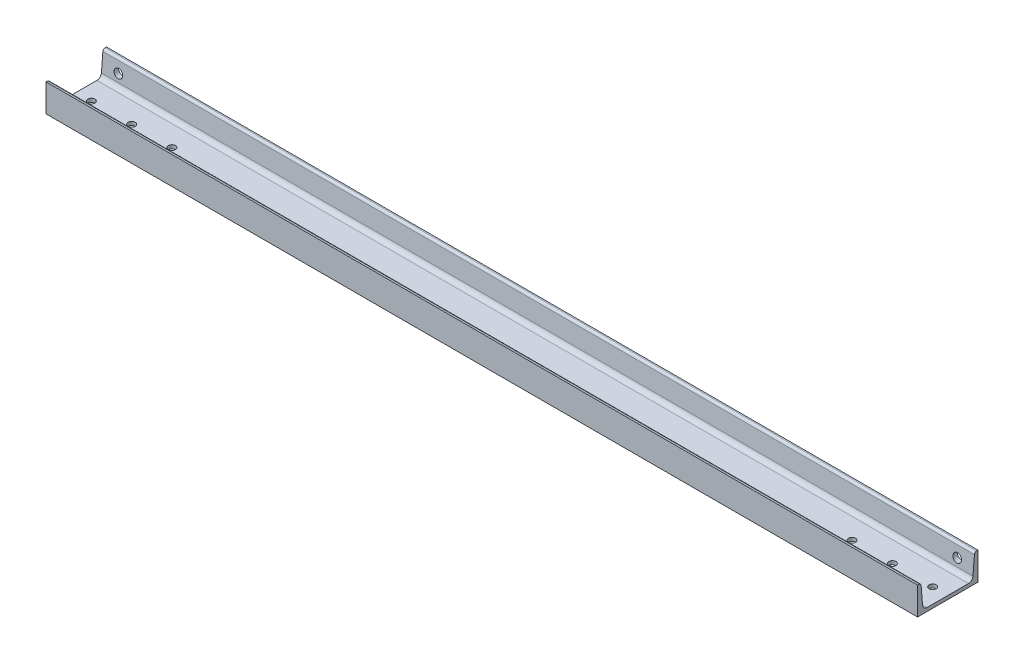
ISO-10303-21;
HEADER;
FILE_DESCRIPTION(('STEP AP214'),'2;1');
FILE_NAME('part.step','',(''),(''),'','','');
FILE_SCHEMA(('AUTOMOTIVE_DESIGN { 1 0 10303 214 1 1 1 1 }'));
ENDSEC;
DATA;
#1=APPLICATION_CONTEXT('core data for automotive mechanical design processes');
#2=APPLICATION_PROTOCOL_DEFINITION('international standard','automotive_design',2000,#1);
#3=PRODUCT_CONTEXT('',#1,'mechanical');
#4=PRODUCT('Part','Part','',(#3));
#5=PRODUCT_RELATED_PRODUCT_CATEGORY('part','',(#4));
#6=PRODUCT_DEFINITION_FORMATION('','',#4);
#7=PRODUCT_DEFINITION_CONTEXT('part definition',#1,'design');
#8=PRODUCT_DEFINITION('design','',#6,#7);
#9=PRODUCT_DEFINITION_SHAPE('','',#8);
#10=(LENGTH_UNIT() NAMED_UNIT(*) SI_UNIT(.MILLI.,.METRE.));
#11=(NAMED_UNIT(*) PLANE_ANGLE_UNIT() SI_UNIT($,.RADIAN.));
#12=(NAMED_UNIT(*) SI_UNIT($,.STERADIAN.) SOLID_ANGLE_UNIT());
#13=UNCERTAINTY_MEASURE_WITH_UNIT(LENGTH_MEASURE(1.E-05),#10,'distance_accuracy_value','');
#14=(GEOMETRIC_REPRESENTATION_CONTEXT(3) GLOBAL_UNCERTAINTY_ASSIGNED_CONTEXT((#13)) GLOBAL_UNIT_ASSIGNED_CONTEXT((#10,
#11,#12)) REPRESENTATION_CONTEXT('',''));
#15=CARTESIAN_POINT('',(0.,0.,0.));
#16=DIRECTION('',(0.,0.,1.));
#17=DIRECTION('',(1.,0.,0.));
#18=AXIS2_PLACEMENT_3D('',#15,#16,#17);
#19=CARTESIAN_POINT('',(865.,6.99999999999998,-41.052087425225));
#20=DIRECTION('',(0.,-1.,0.));
#21=DIRECTION('',(0.,0.,-1.));
#22=AXIS2_PLACEMENT_3D('',#19,#20,#21);
#23=PLANE('',#22);
#24=CARTESIAN_POINT('',(-755.,7.00000000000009,-4.16333634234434E-13));
#25=DIRECTION('',(0.,-1.,0.));
#26=DIRECTION('',(0.,0.,-1.));
#27=AXIS2_PLACEMENT_3D('',#24,#25,#26);
#28=CIRCLE('',#27,6.99999999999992);
#29=CARTESIAN_POINT('',(-755.,7.00000000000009,-7.00000000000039));
#30=VERTEX_POINT('',#29);
#31=EDGE_CURVE('E236',#30,#30,#28,.F.);
#32=ORIENTED_EDGE('',*,*,#31,.F.);
#33=EDGE_LOOP('',(#32));
#34=FACE_BOUND('',#33,.T.);
#35=DIRECTION('',(0.,0.,1.));
#36=VECTOR('',#35,1.);
#37=CARTESIAN_POINT('',(-865.,7.00000000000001,-41.0520874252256));
#38=LINE('',#37,#36);
#39=CARTESIAN_POINT('',(-865.,7.00000000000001,-41.0520874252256));
#40=VERTEX_POINT('',#39);
#41=CARTESIAN_POINT('',(-865.,7.00000000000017,41.0520874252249));
#42=VERTEX_POINT('',#41);
#43=EDGE_CURVE('E151',#40,#42,#38,.T.);
#44=ORIENTED_EDGE('',*,*,#43,.T.);
#45=DIRECTION('',(-1.,0.,0.));
#46=VECTOR('',#45,1.);
#47=CARTESIAN_POINT('',(865.,7.00000000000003,41.0520874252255));
#48=LINE('',#47,#46);
#49=CARTESIAN_POINT('',(865.,7.00000000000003,41.0520874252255));
#50=VERTEX_POINT('',#49);
#51=EDGE_CURVE('E202',#50,#42,#48,.T.);
#52=ORIENTED_EDGE('',*,*,#51,.F.);
#53=DIRECTION('',(0.,0.,1.));
#54=VECTOR('',#53,1.);
#55=CARTESIAN_POINT('',(865.,6.99999999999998,-41.052087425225));
#56=LINE('',#55,#54);
#57=CARTESIAN_POINT('',(865.,6.99999999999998,-41.052087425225));
#58=VERTEX_POINT('',#57);
#59=EDGE_CURVE('E174',#58,#50,#56,.T.);
#60=ORIENTED_EDGE('',*,*,#59,.F.);
#61=DIRECTION('',(-1.,0.,0.));
#62=VECTOR('',#61,1.);
#63=CARTESIAN_POINT('',(865.,6.99999999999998,-41.052087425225));
#64=LINE('',#63,#62);
#65=EDGE_CURVE('E205',#58,#40,#64,.T.);
#66=ORIENTED_EDGE('',*,*,#65,.T.);
#67=EDGE_LOOP('',(#44,#52,#60,#66));
#68=FACE_BOUND('',#67,.T.);
#69=CARTESIAN_POINT('',(834.999999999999,6.9999999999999,2.22044604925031E-13));
#70=DIRECTION('',(0.,-1.,0.));
#71=DIRECTION('',(0.,0.,-1.));
#72=AXIS2_PLACEMENT_3D('',#69,#70,#71);
#73=CIRCLE('',#72,6.99999999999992);
#74=CARTESIAN_POINT('',(834.999999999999,6.9999999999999,-6.99999999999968));
#75=VERTEX_POINT('',#74);
#76=EDGE_CURVE('E139',#75,#75,#73,.T.);
#77=ORIENTED_EDGE('',*,*,#76,.T.);
#78=EDGE_LOOP('',(#77));
#79=FACE_BOUND('',#78,.T.);
#80=CARTESIAN_POINT('',(754.999999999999,7.00000000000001,2.22044604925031E-13));
#81=DIRECTION('',(0.,-1.,0.));
#82=DIRECTION('',(0.,0.,-1.));
#83=AXIS2_PLACEMENT_3D('',#80,#81,#82);
#84=CIRCLE('',#83,6.99999999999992);
#85=CARTESIAN_POINT('',(755.,7.00000000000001,-6.99999999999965));
#86=VERTEX_POINT('',#85);
#87=EDGE_CURVE('E254',#86,#86,#84,.T.);
#88=ORIENTED_EDGE('',*,*,#87,.T.);
#89=EDGE_LOOP('',(#88));
#90=FACE_BOUND('',#89,.T.);
#91=CARTESIAN_POINT('',(674.999999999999,6.9999999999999,2.4980018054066E-13));
#92=DIRECTION('',(0.,-1.,0.));
#93=DIRECTION('',(0.,0.,-1.));
#94=AXIS2_PLACEMENT_3D('',#91,#92,#93);
#95=CIRCLE('',#94,6.99999999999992);
#96=CARTESIAN_POINT('',(675.,6.9999999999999,-6.99999999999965));
#97=VERTEX_POINT('',#96);
#98=EDGE_CURVE('E248',#97,#97,#95,.T.);
#99=ORIENTED_EDGE('',*,*,#98,.T.);
#100=EDGE_LOOP('',(#99));
#101=FACE_BOUND('',#100,.T.);
#102=CARTESIAN_POINT('',(-835.,7.00000000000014,-3.7470027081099E-13));
#103=DIRECTION('',(0.,-1.,0.));
#104=DIRECTION('',(0.,0.,-1.));
#105=AXIS2_PLACEMENT_3D('',#102,#103,#104);
#106=CIRCLE('',#105,6.99999999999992);
#107=CARTESIAN_POINT('',(-835.,7.00000000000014,-7.00000000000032));
#108=VERTEX_POINT('',#107);
#109=EDGE_CURVE('E242',#108,#108,#106,.F.);
#110=ORIENTED_EDGE('',*,*,#109,.F.);
#111=EDGE_LOOP('',(#110));
#112=FACE_BOUND('',#111,.T.);
#113=CARTESIAN_POINT('',(-675.,7.00000000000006,-3.33066907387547E-13));
#114=DIRECTION('',(0.,-1.,0.));
#115=DIRECTION('',(0.,0.,-1.));
#116=AXIS2_PLACEMENT_3D('',#113,#114,#115);
#117=CIRCLE('',#116,6.99999999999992);
#118=CARTESIAN_POINT('',(-675.,7.00000000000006,-7.00000000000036));
#119=VERTEX_POINT('',#118);
#120=EDGE_CURVE('E221',#119,#119,#117,.F.);
#121=ORIENTED_EDGE('',*,*,#120,.F.);
#122=EDGE_LOOP('',(#121));
#123=FACE_BOUND('',#122,.T.);
#124=ADVANCED_FACE('F30',(#34,#68,#79,#90,#101,#112,#123),#23,.F.);
#125=CARTESIAN_POINT('',(865.,0.,60.0000000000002));
#126=DIRECTION('',(0.,1.,0.));
#127=DIRECTION('',(0.,0.,1.));
#128=AXIS2_PLACEMENT_3D('',#125,#126,#127);
#129=PLANE('',#128);
#130=CARTESIAN_POINT('',(-755.,0.,-4.16333634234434E-13));
#131=DIRECTION('',(0.,1.,0.));
#132=DIRECTION('',(0.,0.,-1.));
#133=AXIS2_PLACEMENT_3D('',#130,#131,#132);
#134=CIRCLE('',#133,6.99999999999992);
#135=CARTESIAN_POINT('',(-755.,0.,-7.00000000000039));
#136=VERTEX_POINT('',#135);
#137=EDGE_CURVE('E233',#136,#136,#134,.T.);
#138=ORIENTED_EDGE('',*,*,#137,.T.);
#139=EDGE_LOOP('',(#138));
#140=FACE_BOUND('',#139,.T.);
#141=DIRECTION('',(0.,0.,-1.));
#142=VECTOR('',#141,1.);
#143=CARTESIAN_POINT('',(-865.,1.11022302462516E-13,59.9999999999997));
#144=LINE('',#143,#142);
#145=CARTESIAN_POINT('',(-865.,1.11022302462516E-13,59.9999999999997));
#146=VERTEX_POINT('',#145);
#147=CARTESIAN_POINT('',(-865.,1.66533453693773E-13,-60.0000000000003));
#148=VERTEX_POINT('',#147);
#149=EDGE_CURVE('E163',#146,#148,#144,.T.);
#150=ORIENTED_EDGE('',*,*,#149,.T.);
#151=DIRECTION('',(-1.,0.,0.));
#152=VECTOR('',#151,1.);
#153=CARTESIAN_POINT('',(865.,0.,-59.9999999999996));
#154=LINE('',#153,#152);
#155=CARTESIAN_POINT('',(865.,0.,-59.9999999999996));
#156=VERTEX_POINT('',#155);
#157=EDGE_CURVE('E138',#156,#148,#154,.T.);
#158=ORIENTED_EDGE('',*,*,#157,.F.);
#159=DIRECTION('',(0.,0.,-1.));
#160=VECTOR('',#159,1.);
#161=CARTESIAN_POINT('',(865.,0.,60.0000000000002));
#162=LINE('',#161,#160);
#163=CARTESIAN_POINT('',(865.,0.,60.0000000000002));
#164=VERTEX_POINT('',#163);
#165=EDGE_CURVE('E47',#164,#156,#162,.T.);
#166=ORIENTED_EDGE('',*,*,#165,.F.);
#167=DIRECTION('',(-1.,0.,0.));
#168=VECTOR('',#167,1.);
#169=CARTESIAN_POINT('',(865.,0.,60.0000000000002));
#170=LINE('',#169,#168);
#171=EDGE_CURVE('E187',#164,#146,#170,.T.);
#172=ORIENTED_EDGE('',*,*,#171,.T.);
#173=EDGE_LOOP('',(#150,#158,#166,#172));
#174=FACE_BOUND('',#173,.T.);
#175=CARTESIAN_POINT('',(834.999999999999,-1.94289029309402E-13,1.11022302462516E-13));
#176=DIRECTION('',(0.,-1.,0.));
#177=DIRECTION('',(0.,0.,-1.));
#178=AXIS2_PLACEMENT_3D('',#175,#176,#177);
#179=CIRCLE('',#178,6.99999999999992);
#180=CARTESIAN_POINT('',(834.999999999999,-1.94289029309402E-13,-6.99999999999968));
#181=VERTEX_POINT('',#180);
#182=EDGE_CURVE('E142',#181,#181,#179,.T.);
#183=ORIENTED_EDGE('',*,*,#182,.F.);
#184=EDGE_LOOP('',(#183));
#185=FACE_BOUND('',#184,.T.);
#186=CARTESIAN_POINT('',(755.,0.,2.77555756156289E-13));
#187=DIRECTION('',(0.,-1.,0.));
#188=DIRECTION('',(0.,0.,-1.));
#189=AXIS2_PLACEMENT_3D('',#186,#187,#188);
#190=CIRCLE('',#189,6.99999999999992);
#191=CARTESIAN_POINT('',(755.,0.,-6.99999999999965));
#192=VERTEX_POINT('',#191);
#193=EDGE_CURVE('E251',#192,#192,#190,.T.);
#194=ORIENTED_EDGE('',*,*,#193,.F.);
#195=EDGE_LOOP('',(#194));
#196=FACE_BOUND('',#195,.T.);
#197=CARTESIAN_POINT('',(674.999999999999,0.,1.94289029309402E-13));
#198=DIRECTION('',(0.,-1.,0.));
#199=DIRECTION('',(0.,0.,-1.));
#200=AXIS2_PLACEMENT_3D('',#197,#198,#199);
#201=CIRCLE('',#200,6.99999999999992);
#202=CARTESIAN_POINT('',(675.,0.,-6.99999999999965));
#203=VERTEX_POINT('',#202);
#204=EDGE_CURVE('E245',#203,#203,#201,.T.);
#205=ORIENTED_EDGE('',*,*,#204,.F.);
#206=EDGE_LOOP('',(#205));
#207=FACE_BOUND('',#206,.T.);
#208=CARTESIAN_POINT('',(-835.,1.11022302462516E-13,-3.05311331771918E-13));
#209=DIRECTION('',(0.,1.,0.));
#210=DIRECTION('',(0.,0.,-1.));
#211=AXIS2_PLACEMENT_3D('',#208,#209,#210);
#212=CIRCLE('',#211,6.99999999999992);
#213=CARTESIAN_POINT('',(-835.,1.11022302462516E-13,-7.00000000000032));
#214=VERTEX_POINT('',#213);
#215=EDGE_CURVE('E239',#214,#214,#212,.T.);
#216=ORIENTED_EDGE('',*,*,#215,.T.);
#217=EDGE_LOOP('',(#216));
#218=FACE_BOUND('',#217,.T.);
#219=CARTESIAN_POINT('',(-675.,0.,-3.05311331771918E-13));
#220=DIRECTION('',(0.,1.,0.));
#221=DIRECTION('',(0.,0.,-1.));
#222=AXIS2_PLACEMENT_3D('',#219,#220,#221);
#223=CIRCLE('',#222,6.99999999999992);
#224=CARTESIAN_POINT('',(-675.,0.,-7.00000000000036));
#225=VERTEX_POINT('',#224);
#226=EDGE_CURVE('E216',#225,#225,#223,.T.);
#227=ORIENTED_EDGE('',*,*,#226,.T.);
#228=EDGE_LOOP('',(#227));
#229=FACE_BOUND('',#228,.T.);
#230=ADVANCED_FACE('F262',(#140,#174,#185,#196,#207,#218,#229),#129,.F.);
#231=CARTESIAN_POINT('',(865.,0.,-59.9999999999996));
#232=DIRECTION('',(0.,0.,1.));
#233=DIRECTION('',(0.,-1.,0.));
#234=AXIS2_PLACEMENT_3D('',#231,#232,#233);
#235=PLANE('',#234);
#236=CARTESIAN_POINT('',(832.499999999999,29.9999999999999,-59.9999999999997));
#237=DIRECTION('',(0.,0.,-1.));
#238=DIRECTION('',(0.,1.,0.));
#239=AXIS2_PLACEMENT_3D('',#236,#237,#238);
#240=CIRCLE('',#239,8.4999999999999);
#241=CARTESIAN_POINT('',(832.499999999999,38.4999999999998,-59.9999999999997));
#242=VERTEX_POINT('',#241);
#243=EDGE_CURVE('E228',#242,#242,#240,.T.);
#244=ORIENTED_EDGE('',*,*,#243,.F.);
#245=EDGE_LOOP('',(#244));
#246=FACE_BOUND('',#245,.T.);
#247=CARTESIAN_POINT('',(-832.5,30.,-60.0000000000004));
#248=DIRECTION('',(0.,0.,-1.));
#249=DIRECTION('',(0.,1.,0.));
#250=AXIS2_PLACEMENT_3D('',#247,#248,#249);
#251=CIRCLE('',#250,8.4999999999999);
#252=CARTESIAN_POINT('',(-832.5,38.4999999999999,-60.0000000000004));
#253=VERTEX_POINT('',#252);
#254=EDGE_CURVE('E217',#253,#253,#251,.T.);
#255=ORIENTED_EDGE('',*,*,#254,.F.);
#256=EDGE_LOOP('',(#255));
#257=FACE_BOUND('',#256,.T.);
#258=DIRECTION('',(0.,1.,0.));
#259=VECTOR('',#258,1.);
#260=CARTESIAN_POINT('',(-865.,1.66533453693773E-13,-60.0000000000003));
#261=LINE('',#260,#259);
#262=CARTESIAN_POINT('',(-865.,55.0000000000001,-60.0000000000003));
#263=VERTEX_POINT('',#262);
#264=EDGE_CURVE('E125',#148,#263,#261,.T.);
#265=ORIENTED_EDGE('',*,*,#264,.T.);
#266=DIRECTION('',(-1.,0.,0.));
#267=VECTOR('',#266,1.);
#268=CARTESIAN_POINT('',(864.999999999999,54.9999999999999,-59.9999999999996));
#269=LINE('',#268,#267);
#270=CARTESIAN_POINT('',(864.999999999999,54.9999999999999,-59.9999999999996));
#271=VERTEX_POINT('',#270);
#272=EDGE_CURVE('E11',#271,#263,#269,.T.);
#273=ORIENTED_EDGE('',*,*,#272,.F.);
#274=DIRECTION('',(0.,1.,0.));
#275=VECTOR('',#274,1.);
#276=CARTESIAN_POINT('',(865.,0.,-59.9999999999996));
#277=LINE('',#276,#275);
#278=EDGE_CURVE('E165',#156,#271,#277,.T.);
#279=ORIENTED_EDGE('',*,*,#278,.F.);
#280=ORIENTED_EDGE('',*,*,#157,.T.);
#281=EDGE_LOOP('',(#265,#273,#279,#280));
#282=FACE_BOUND('',#281,.T.);
#283=ADVANCED_FACE('F32',(#246,#257,#282),#235,.F.);
#284=CARTESIAN_POINT('',(864.999999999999,54.9999999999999,-59.9999999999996));
#285=DIRECTION('',(0.,-1.,0.));
#286=DIRECTION('',(0.,0.,-1.));
#287=AXIS2_PLACEMENT_3D('',#284,#285,#286);
#288=PLANE('',#287);
#289=DIRECTION('',(0.,0.,1.));
#290=VECTOR('',#289,1.);
#291=CARTESIAN_POINT('',(-865.,55.0000000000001,-60.0000000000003));
#292=LINE('',#291,#290);
#293=CARTESIAN_POINT('',(-865.,55.0000000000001,-57.352768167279));
#294=VERTEX_POINT('',#293);
#295=EDGE_CURVE('E121',#263,#294,#292,.T.);
#296=ORIENTED_EDGE('',*,*,#295,.T.);
#297=DIRECTION('',(-1.,0.,0.));
#298=VECTOR('',#297,1.);
#299=CARTESIAN_POINT('',(865.,54.9999999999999,-57.3527681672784));
#300=LINE('',#299,#298);
#301=CARTESIAN_POINT('',(865.,54.9999999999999,-57.3527681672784));
#302=VERTEX_POINT('',#301);
#303=EDGE_CURVE('E39',#302,#294,#300,.T.);
#304=ORIENTED_EDGE('',*,*,#303,.F.);
#305=DIRECTION('',(0.,0.,1.));
#306=VECTOR('',#305,1.);
#307=CARTESIAN_POINT('',(864.999999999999,54.9999999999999,-59.9999999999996));
#308=LINE('',#307,#306);
#309=EDGE_CURVE('E134',#271,#302,#308,.T.);
#310=ORIENTED_EDGE('',*,*,#309,.F.);
#311=ORIENTED_EDGE('',*,*,#272,.T.);
#312=EDGE_LOOP('',(#296,#304,#310,#311));
#313=FACE_BOUND('',#312,.T.);
#314=ADVANCED_FACE('F133',(#313),#288,.F.);
#315=CARTESIAN_POINT('',(864.999999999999,50.4999999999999,-57.3527681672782));
#316=DIRECTION('',(-1.,0.,0.));
#317=DIRECTION('',(0.,0.,1.));
#318=AXIS2_PLACEMENT_3D('',#315,#316,#317);
#319=CYLINDRICAL_SURFACE('',#318,4.5);
#320=CARTESIAN_POINT('',(-865.,50.5000000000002,-57.3527681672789));
#321=DIRECTION('',(1.,0.,0.));
#322=DIRECTION('',(0.,0.,-1.));
#323=AXIS2_PLACEMENT_3D('',#320,#321,#322);
#324=CIRCLE('',#323,4.5);
#325=CARTESIAN_POINT('',(-865.,50.8585465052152,-52.8670748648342));
#326=VERTEX_POINT('',#325);
#327=EDGE_CURVE('E127',#294,#326,#324,.T.);
#328=ORIENTED_EDGE('',*,*,#327,.T.);
#329=DIRECTION('',(-1.,0.,0.));
#330=VECTOR('',#329,1.);
#331=CARTESIAN_POINT('',(865.,50.858546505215,-52.8670748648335));
#332=LINE('',#331,#330);
#333=CARTESIAN_POINT('',(865.,50.858546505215,-52.8670748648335));
#334=VERTEX_POINT('',#333);
#335=EDGE_CURVE('E211',#334,#326,#332,.T.);
#336=ORIENTED_EDGE('',*,*,#335,.F.);
#337=CARTESIAN_POINT('',(864.999999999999,50.4999999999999,-57.3527681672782));
#338=DIRECTION('',(1.,0.,0.));
#339=DIRECTION('',(0.,0.,-1.));
#340=AXIS2_PLACEMENT_3D('',#337,#338,#339);
#341=CIRCLE('',#340,4.5);
#342=EDGE_CURVE('E168',#302,#334,#341,.T.);
#343=ORIENTED_EDGE('',*,*,#342,.F.);
#344=ORIENTED_EDGE('',*,*,#303,.T.);
#345=EDGE_LOOP('',(#328,#336,#343,#344));
#346=FACE_BOUND('',#345,.T.);
#347=ADVANCED_FACE('F301',(#346),#319,.T.);
#348=CARTESIAN_POINT('',(865.,50.858546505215,-52.8670748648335));
#349=DIRECTION('',(0.,-0.0796770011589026,-0.99682073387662));
#350=DIRECTION('',(0.,0.996820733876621,-0.0796770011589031));
#351=AXIS2_PLACEMENT_3D('',#348,#349,#350);
#352=PLANE('',#351);
#353=CARTESIAN_POINT('',(832.499999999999,29.9999999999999,-51.1998278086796));
#354=DIRECTION('',(0.,-0.0796770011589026,-0.99682073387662));
#355=DIRECTION('',(0.,0.996820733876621,-0.0796770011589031));
#356=AXIS2_PLACEMENT_3D('',#353,#354,#355);
#357=ELLIPSE('',#356,8.52710995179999,8.4999999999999);
#358=CARTESIAN_POINT('',(832.499999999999,38.4999999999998,-51.8792423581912));
#359=VERTEX_POINT('',#358);
#360=EDGE_CURVE('E34',#359,#359,#357,.T.);
#361=ORIENTED_EDGE('',*,*,#360,.T.);
#362=EDGE_LOOP('',(#361));
#363=FACE_BOUND('',#362,.T.);
#364=CARTESIAN_POINT('',(-832.5,30.0000000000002,-51.1998278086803));
#365=DIRECTION('',(0.,-0.0796770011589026,-0.99682073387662));
#366=DIRECTION('',(0.,0.996820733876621,-0.0796770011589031));
#367=AXIS2_PLACEMENT_3D('',#364,#365,#366);
#368=ELLIPSE('',#367,8.52710995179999,8.4999999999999);
#369=CARTESIAN_POINT('',(-832.5,38.5000000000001,-51.879242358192));
#370=VERTEX_POINT('',#369);
#371=EDGE_CURVE('E214',#370,#370,#368,.T.);
#372=ORIENTED_EDGE('',*,*,#371,.T.);
#373=EDGE_LOOP('',(#372));
#374=FACE_BOUND('',#373,.T.);
#375=DIRECTION('',(0.,-0.99682073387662,0.0796770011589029));
#376=VECTOR('',#375,1.);
#377=CARTESIAN_POINT('',(-865.,50.8585465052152,-52.8670748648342));
#378=LINE('',#377,#376);
#379=CARTESIAN_POINT('',(-865.,15.28290698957,-50.0234740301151));
#380=VERTEX_POINT('',#379);
#381=EDGE_CURVE('E147',#326,#380,#378,.T.);
#382=ORIENTED_EDGE('',*,*,#381,.T.);
#383=DIRECTION('',(-1.,0.,0.));
#384=VECTOR('',#383,1.);
#385=CARTESIAN_POINT('',(864.999999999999,15.2829069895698,-50.0234740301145));
#386=LINE('',#385,#384);
#387=CARTESIAN_POINT('',(864.999999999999,15.2829069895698,-50.0234740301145));
#388=VERTEX_POINT('',#387);
#389=EDGE_CURVE('E208',#388,#380,#386,.T.);
#390=ORIENTED_EDGE('',*,*,#389,.F.);
#391=DIRECTION('',(0.,-0.99682073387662,0.0796770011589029));
#392=VECTOR('',#391,1.);
#393=CARTESIAN_POINT('',(865.,50.858546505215,-52.8670748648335));
#394=LINE('',#393,#392);
#395=EDGE_CURVE('E170',#334,#388,#394,.T.);
#396=ORIENTED_EDGE('',*,*,#395,.F.);
#397=ORIENTED_EDGE('',*,*,#335,.T.);
#398=EDGE_LOOP('',(#382,#390,#396,#397));
#399=FACE_BOUND('',#398,.T.);
#400=ADVANCED_FACE('F297',(#363,#374,#399),#352,.F.);
#401=CARTESIAN_POINT('',(864.999999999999,15.9999999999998,-41.0520874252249));
#402=DIRECTION('',(-1.,0.,0.));
#403=DIRECTION('',(0.,0.,1.));
#404=AXIS2_PLACEMENT_3D('',#401,#402,#403);
#405=CYLINDRICAL_SURFACE('',#404,9.);
#406=CARTESIAN_POINT('',(-865.,16.,-41.0520874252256));
#407=DIRECTION('',(-1.,0.,0.));
#408=DIRECTION('',(0.,0.,1.));
#409=AXIS2_PLACEMENT_3D('',#406,#407,#408);
#410=CIRCLE('',#409,9.);
#411=EDGE_CURVE('E149',#380,#40,#410,.T.);
#412=ORIENTED_EDGE('',*,*,#411,.T.);
#413=ORIENTED_EDGE('',*,*,#65,.F.);
#414=CARTESIAN_POINT('',(864.999999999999,15.9999999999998,-41.0520874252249));
#415=DIRECTION('',(-1.,0.,0.));
#416=DIRECTION('',(0.,0.,1.));
#417=AXIS2_PLACEMENT_3D('',#414,#415,#416);
#418=CIRCLE('',#417,9.);
#419=EDGE_CURVE('E172',#388,#58,#418,.T.);
#420=ORIENTED_EDGE('',*,*,#419,.F.);
#421=ORIENTED_EDGE('',*,*,#389,.T.);
#422=EDGE_LOOP('',(#412,#413,#420,#421));
#423=FACE_BOUND('',#422,.T.);
#424=ADVANCED_FACE('F294',(#423),#405,.F.);
#425=CARTESIAN_POINT('',(864.999999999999,15.9999999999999,41.0520874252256));
#426=DIRECTION('',(-1.,0.,0.));
#427=DIRECTION('',(0.,0.,1.));
#428=AXIS2_PLACEMENT_3D('',#425,#426,#427);
#429=CYLINDRICAL_SURFACE('',#428,9.);
#430=CARTESIAN_POINT('',(-865.,16.,41.052087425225));
#431=DIRECTION('',(-1.,0.,0.));
#432=DIRECTION('',(0.,0.,-1.));
#433=AXIS2_PLACEMENT_3D('',#430,#431,#432);
#434=CIRCLE('',#433,9.);
#435=CARTESIAN_POINT('',(-865.,15.28290698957,50.0234740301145));
#436=VERTEX_POINT('',#435);
#437=EDGE_CURVE('E153',#42,#436,#434,.T.);
#438=ORIENTED_EDGE('',*,*,#437,.T.);
#439=DIRECTION('',(-1.,0.,0.));
#440=VECTOR('',#439,1.);
#441=CARTESIAN_POINT('',(864.999999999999,15.2829069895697,50.0234740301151));
#442=LINE('',#441,#440);
#443=CARTESIAN_POINT('',(864.999999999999,15.2829069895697,50.0234740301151));
#444=VERTEX_POINT('',#443);
#445=EDGE_CURVE('E199',#444,#436,#442,.T.);
#446=ORIENTED_EDGE('',*,*,#445,.F.);
#447=CARTESIAN_POINT('',(864.999999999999,15.9999999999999,41.0520874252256));
#448=DIRECTION('',(-1.,0.,0.));
#449=DIRECTION('',(0.,0.,-1.));
#450=AXIS2_PLACEMENT_3D('',#447,#448,#449);
#451=CIRCLE('',#450,9.);
#452=EDGE_CURVE('E176',#50,#444,#451,.T.);
#453=ORIENTED_EDGE('',*,*,#452,.F.);
#454=ORIENTED_EDGE('',*,*,#51,.T.);
#455=EDGE_LOOP('',(#438,#446,#453,#454));
#456=FACE_BOUND('',#455,.T.);
#457=ADVANCED_FACE('F292',(#456),#429,.F.);
#458=CARTESIAN_POINT('',(865.,50.8585465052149,52.8670748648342));
#459=DIRECTION('',(0.,-0.079677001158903,0.99682073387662));
#460=DIRECTION('',(0.,-0.996820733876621,-0.0796770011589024));
#461=AXIS2_PLACEMENT_3D('',#458,#459,#460);
#462=PLANE('',#461);
#463=DIRECTION('',(0.,0.99682073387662,0.0796770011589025));
#464=VECTOR('',#463,1.);
#465=CARTESIAN_POINT('',(-865.,50.8585465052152,52.8670748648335));
#466=LINE('',#465,#464);
#467=CARTESIAN_POINT('',(-865.,50.8585465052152,52.8670748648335));
#468=VERTEX_POINT('',#467);
#469=EDGE_CURVE('E155',#436,#468,#466,.T.);
#470=ORIENTED_EDGE('',*,*,#469,.T.);
#471=DIRECTION('',(-1.,0.,0.));
#472=VECTOR('',#471,1.);
#473=CARTESIAN_POINT('',(865.,50.8585465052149,52.8670748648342));
#474=LINE('',#473,#472);
#475=CARTESIAN_POINT('',(865.,50.8585465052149,52.8670748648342));
#476=VERTEX_POINT('',#475);
#477=EDGE_CURVE('E196',#476,#468,#474,.T.);
#478=ORIENTED_EDGE('',*,*,#477,.F.);
#479=DIRECTION('',(0.,0.99682073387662,0.0796770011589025));
#480=VECTOR('',#479,1.);
#481=CARTESIAN_POINT('',(865.,50.8585465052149,52.8670748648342));
#482=LINE('',#481,#480);
#483=EDGE_CURVE('E178',#444,#476,#482,.T.);
#484=ORIENTED_EDGE('',*,*,#483,.F.);
#485=ORIENTED_EDGE('',*,*,#445,.T.);
#486=EDGE_LOOP('',(#470,#478,#484,#485));
#487=FACE_BOUND('',#486,.T.);
#488=ADVANCED_FACE('F344',(#487),#462,.F.);
#489=CARTESIAN_POINT('',(865.,50.5,57.3527681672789));
#490=DIRECTION('',(-1.,0.,0.));
#491=DIRECTION('',(0.,0.,1.));
#492=AXIS2_PLACEMENT_3D('',#489,#490,#491);
#493=CYLINDRICAL_SURFACE('',#492,4.5);
#494=CARTESIAN_POINT('',(-865.,50.5000000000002,57.3527681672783));
#495=DIRECTION('',(1.,0.,0.));
#496=DIRECTION('',(0.,0.,1.));
#497=AXIS2_PLACEMENT_3D('',#494,#495,#496);
#498=CIRCLE('',#497,4.5);
#499=CARTESIAN_POINT('',(-865.,55.,57.3527681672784));
#500=VERTEX_POINT('',#499);
#501=EDGE_CURVE('E157',#468,#500,#498,.T.);
#502=ORIENTED_EDGE('',*,*,#501,.T.);
#503=DIRECTION('',(-1.,0.,0.));
#504=VECTOR('',#503,1.);
#505=CARTESIAN_POINT('',(865.,54.9999999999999,57.352768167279));
#506=LINE('',#505,#504);
#507=CARTESIAN_POINT('',(865.,54.9999999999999,57.352768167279));
#508=VERTEX_POINT('',#507);
#509=EDGE_CURVE('E193',#508,#500,#506,.T.);
#510=ORIENTED_EDGE('',*,*,#509,.F.);
#511=CARTESIAN_POINT('',(865.,50.5,57.3527681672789));
#512=DIRECTION('',(1.,0.,0.));
#513=DIRECTION('',(0.,0.,1.));
#514=AXIS2_PLACEMENT_3D('',#511,#512,#513);
#515=CIRCLE('',#514,4.5);
#516=EDGE_CURVE('E180',#476,#508,#515,.T.);
#517=ORIENTED_EDGE('',*,*,#516,.F.);
#518=ORIENTED_EDGE('',*,*,#477,.T.);
#519=EDGE_LOOP('',(#502,#510,#517,#518));
#520=FACE_BOUND('',#519,.T.);
#521=ADVANCED_FACE('F347',(#520),#493,.T.);
#522=CARTESIAN_POINT('',(864.999999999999,54.9999999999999,60.0000000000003));
#523=DIRECTION('',(0.,-1.,0.));
#524=DIRECTION('',(0.,0.,-1.));
#525=AXIS2_PLACEMENT_3D('',#522,#523,#524);
#526=PLANE('',#525);
#527=DIRECTION('',(0.,0.,1.));
#528=VECTOR('',#527,1.);
#529=CARTESIAN_POINT('',(-865.,55.,59.9999999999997));
#530=LINE('',#529,#528);
#531=CARTESIAN_POINT('',(-865.,55.,59.9999999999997));
#532=VERTEX_POINT('',#531);
#533=EDGE_CURVE('E159',#500,#532,#530,.T.);
#534=ORIENTED_EDGE('',*,*,#533,.T.);
#535=DIRECTION('',(-1.,0.,0.));
#536=VECTOR('',#535,1.);
#537=CARTESIAN_POINT('',(864.999999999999,54.9999999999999,60.0000000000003));
#538=LINE('',#537,#536);
#539=CARTESIAN_POINT('',(864.999999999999,54.9999999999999,60.0000000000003));
#540=VERTEX_POINT('',#539);
#541=EDGE_CURVE('E190',#540,#532,#538,.T.);
#542=ORIENTED_EDGE('',*,*,#541,.F.);
#543=DIRECTION('',(0.,0.,1.));
#544=VECTOR('',#543,1.);
#545=CARTESIAN_POINT('',(864.999999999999,54.9999999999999,60.0000000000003));
#546=LINE('',#545,#544);
#547=EDGE_CURVE('E182',#508,#540,#546,.T.);
#548=ORIENTED_EDGE('',*,*,#547,.F.);
#549=ORIENTED_EDGE('',*,*,#509,.T.);
#550=EDGE_LOOP('',(#534,#542,#548,#549));
#551=FACE_BOUND('',#550,.T.);
#552=ADVANCED_FACE('F352',(#551),#526,.F.);
#553=CARTESIAN_POINT('',(865.,0.,60.0000000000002));
#554=DIRECTION('',(0.,0.,-1.));
#555=DIRECTION('',(0.,1.,0.));
#556=AXIS2_PLACEMENT_3D('',#553,#554,#555);
#557=PLANE('',#556);
#558=DIRECTION('',(0.,-1.,0.));
#559=VECTOR('',#558,1.);
#560=CARTESIAN_POINT('',(-865.,1.11022302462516E-13,59.9999999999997));
#561=LINE('',#560,#559);
#562=EDGE_CURVE('E161',#532,#146,#561,.T.);
#563=ORIENTED_EDGE('',*,*,#562,.T.);
#564=ORIENTED_EDGE('',*,*,#171,.F.);
#565=DIRECTION('',(0.,-1.,0.));
#566=VECTOR('',#565,1.);
#567=CARTESIAN_POINT('',(865.,0.,60.0000000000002));
#568=LINE('',#567,#566);
#569=EDGE_CURVE('E52',#540,#164,#568,.T.);
#570=ORIENTED_EDGE('',*,*,#569,.F.);
#571=ORIENTED_EDGE('',*,*,#541,.T.);
#572=EDGE_LOOP('',(#563,#564,#570,#571));
#573=FACE_BOUND('',#572,.T.);
#574=ADVANCED_FACE('F355',(#573),#557,.F.);
#575=CARTESIAN_POINT('',(864.999999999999,50.4999999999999,-57.3527681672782));
#576=DIRECTION('',(1.,0.,0.));
#577=DIRECTION('',(0.,0.,-1.));
#578=AXIS2_PLACEMENT_3D('',#575,#576,#577);
#579=PLANE('',#578);
#580=ORIENTED_EDGE('',*,*,#278,.T.);
#581=ORIENTED_EDGE('',*,*,#309,.T.);
#582=ORIENTED_EDGE('',*,*,#342,.T.);
#583=ORIENTED_EDGE('',*,*,#395,.T.);
#584=ORIENTED_EDGE('',*,*,#419,.T.);
#585=ORIENTED_EDGE('',*,*,#59,.T.);
#586=ORIENTED_EDGE('',*,*,#452,.T.);
#587=ORIENTED_EDGE('',*,*,#483,.T.);
#588=ORIENTED_EDGE('',*,*,#516,.T.);
#589=ORIENTED_EDGE('',*,*,#547,.T.);
#590=ORIENTED_EDGE('',*,*,#569,.T.);
#591=ORIENTED_EDGE('',*,*,#165,.T.);
#592=EDGE_LOOP('',(#580,#581,#582,#583,#584,#585,#586,#587,#588,#589,#590,#591));
#593=FACE_BOUND('',#592,.T.);
#594=ADVANCED_FACE('F338',(#593),#579,.T.);
#595=CARTESIAN_POINT('',(-865.,50.5000000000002,-57.3527681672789));
#596=DIRECTION('',(1.,0.,0.));
#597=DIRECTION('',(0.,0.,-1.));
#598=AXIS2_PLACEMENT_3D('',#595,#596,#597);
#599=PLANE('',#598);
#600=ORIENTED_EDGE('',*,*,#264,.F.);
#601=ORIENTED_EDGE('',*,*,#149,.F.);
#602=ORIENTED_EDGE('',*,*,#562,.F.);
#603=ORIENTED_EDGE('',*,*,#533,.F.);
#604=ORIENTED_EDGE('',*,*,#501,.F.);
#605=ORIENTED_EDGE('',*,*,#469,.F.);
#606=ORIENTED_EDGE('',*,*,#437,.F.);
#607=ORIENTED_EDGE('',*,*,#43,.F.);
#608=ORIENTED_EDGE('',*,*,#411,.F.);
#609=ORIENTED_EDGE('',*,*,#381,.F.);
#610=ORIENTED_EDGE('',*,*,#327,.F.);
#611=ORIENTED_EDGE('',*,*,#295,.F.);
#612=EDGE_LOOP('',(#600,#601,#602,#603,#604,#605,#606,#607,#608,#609,#610,#611));
#613=FACE_BOUND('',#612,.T.);
#614=ADVANCED_FACE('F122',(#613),#599,.F.);
#615=CARTESIAN_POINT('',(834.999999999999,54.9999999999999,2.4980018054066E-13));
#616=DIRECTION('',(0.,-1.,0.));
#617=DIRECTION('',(0.,0.,-1.));
#618=AXIS2_PLACEMENT_3D('',#615,#616,#617);
#619=CYLINDRICAL_SURFACE('',#618,6.99999999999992);
#620=CARTESIAN_POINT('',(834.999999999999,-1.94289029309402E-13,-6.99999999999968));
#621=CARTESIAN_POINT('',(834.999999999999,0.0729166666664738,-6.99999999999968));
#622=CARTESIAN_POINT('',(834.999999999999,0.145833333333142,-6.99999999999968));
#623=CARTESIAN_POINT('',(834.999999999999,0.291666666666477,-6.99999999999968));
#624=CARTESIAN_POINT('',(834.999999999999,0.364583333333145,-6.99999999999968));
#625=CARTESIAN_POINT('',(834.999999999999,0.510416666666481,-6.99999999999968));
#626=CARTESIAN_POINT('',(834.999999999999,0.583333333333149,-6.99999999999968));
#627=CARTESIAN_POINT('',(834.999999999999,0.729166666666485,-6.99999999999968));
#628=CARTESIAN_POINT('',(834.999999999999,0.802083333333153,-6.99999999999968));
#629=CARTESIAN_POINT('',(834.999999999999,0.947916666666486,-6.99999999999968));
#630=CARTESIAN_POINT('',(834.999999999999,1.02083333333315,-6.99999999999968));
#631=CARTESIAN_POINT('',(834.999999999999,1.16666666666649,-6.99999999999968));
#632=CARTESIAN_POINT('',(834.999999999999,1.23958333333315,-6.99999999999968));
#633=CARTESIAN_POINT('',(834.999999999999,1.38541666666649,-6.99999999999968));
#634=CARTESIAN_POINT('',(834.999999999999,1.45833333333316,-6.99999999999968));
#635=CARTESIAN_POINT('',(834.999999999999,1.60416666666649,-6.99999999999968));
#636=CARTESIAN_POINT('',(834.999999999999,1.67708333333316,-6.99999999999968));
#637=CARTESIAN_POINT('',(834.999999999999,1.8229166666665,-6.99999999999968));
#638=CARTESIAN_POINT('',(834.999999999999,1.89583333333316,-6.99999999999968));
#639=CARTESIAN_POINT('',(834.999999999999,2.0416666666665,-6.99999999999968));
#640=CARTESIAN_POINT('',(834.999999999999,2.11458333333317,-6.99999999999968));
#641=CARTESIAN_POINT('',(834.999999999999,2.2604166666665,-6.99999999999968));
#642=CARTESIAN_POINT('',(834.999999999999,2.33333333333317,-6.99999999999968));
#643=CARTESIAN_POINT('',(834.999999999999,2.4791666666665,-6.99999999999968));
#644=CARTESIAN_POINT('',(834.999999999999,2.55208333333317,-6.99999999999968));
#645=CARTESIAN_POINT('',(834.999999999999,2.6979166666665,-6.99999999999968));
#646=CARTESIAN_POINT('',(834.999999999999,2.77083333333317,-6.99999999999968));
#647=CARTESIAN_POINT('',(834.999999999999,2.91666666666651,-6.99999999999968));
#648=CARTESIAN_POINT('',(834.999999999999,2.98958333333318,-6.99999999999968));
#649=CARTESIAN_POINT('',(834.999999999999,3.13541666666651,-6.99999999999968));
#650=CARTESIAN_POINT('',(834.999999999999,3.20833333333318,-6.99999999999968));
#651=CARTESIAN_POINT('',(834.999999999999,3.35416666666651,-6.99999999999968));
#652=CARTESIAN_POINT('',(834.999999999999,3.42708333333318,-6.99999999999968));
#653=CARTESIAN_POINT('',(834.999999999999,3.57291666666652,-6.99999999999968));
#654=CARTESIAN_POINT('',(834.999999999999,3.64583333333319,-6.99999999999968));
#655=CARTESIAN_POINT('',(834.999999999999,3.79166666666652,-6.99999999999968));
#656=CARTESIAN_POINT('',(834.999999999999,3.86458333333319,-6.99999999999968));
#657=CARTESIAN_POINT('',(834.999999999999,4.01041666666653,-6.99999999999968));
#658=CARTESIAN_POINT('',(834.999999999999,4.08333333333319,-6.99999999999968));
#659=CARTESIAN_POINT('',(834.999999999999,4.22916666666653,-6.99999999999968));
#660=CARTESIAN_POINT('',(834.999999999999,4.3020833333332,-6.99999999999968));
#661=CARTESIAN_POINT('',(834.999999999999,4.44791666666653,-6.99999999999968));
#662=CARTESIAN_POINT('',(834.999999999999,4.5208333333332,-6.99999999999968));
#663=CARTESIAN_POINT('',(834.999999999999,4.66666666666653,-6.99999999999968));
#664=CARTESIAN_POINT('',(834.999999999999,4.7395833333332,-6.99999999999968));
#665=CARTESIAN_POINT('',(834.999999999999,4.88541666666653,-6.99999999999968));
#666=CARTESIAN_POINT('',(834.999999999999,4.9583333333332,-6.99999999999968));
#667=CARTESIAN_POINT('',(834.999999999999,5.10416666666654,-6.99999999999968));
#668=CARTESIAN_POINT('',(834.999999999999,5.1770833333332,-6.99999999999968));
#669=CARTESIAN_POINT('',(834.999999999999,5.32291666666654,-6.99999999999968));
#670=CARTESIAN_POINT('',(834.999999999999,5.39583333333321,-6.99999999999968));
#671=CARTESIAN_POINT('',(834.999999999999,5.54166666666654,-6.99999999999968));
#672=CARTESIAN_POINT('',(834.999999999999,5.61458333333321,-6.99999999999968));
#673=CARTESIAN_POINT('',(834.999999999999,5.76041666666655,-6.99999999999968));
#674=CARTESIAN_POINT('',(834.999999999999,5.83333333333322,-6.99999999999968));
#675=CARTESIAN_POINT('',(834.999999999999,5.97916666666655,-6.99999999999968));
#676=CARTESIAN_POINT('',(834.999999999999,6.05208333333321,-6.99999999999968));
#677=CARTESIAN_POINT('',(834.999999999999,6.19791666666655,-6.99999999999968));
#678=CARTESIAN_POINT('',(834.999999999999,6.27083333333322,-6.99999999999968));
#679=CARTESIAN_POINT('',(834.999999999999,6.41666666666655,-6.99999999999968));
#680=CARTESIAN_POINT('',(834.999999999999,6.48958333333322,-6.99999999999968));
#681=CARTESIAN_POINT('',(834.999999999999,6.63541666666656,-6.99999999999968));
#682=CARTESIAN_POINT('',(834.999999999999,6.70833333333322,-6.99999999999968));
#683=CARTESIAN_POINT('',(834.999999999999,6.85416666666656,-6.99999999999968));
#684=CARTESIAN_POINT('',(834.999999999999,6.92708333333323,-6.99999999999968));
#685=CARTESIAN_POINT('',(834.999999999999,6.9999999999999,-6.99999999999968));
#686=B_SPLINE_CURVE_WITH_KNOTS('',3,(#620,#621,#622,#623,#624,#625,#626,#627,#628,#629,#630,
#631,#632,#633,#634,#635,#636,#637,#638,#639,#640,#641,#642,#643,#644,#645,#646,#647,#648,#649,
#650,#651,#652,#653,#654,#655,#656,#657,#658,#659,#660,#661,#662,#663,#664,#665,#666,#667,#668,
#669,#670,#671,#672,#673,#674,#675,#676,#677,#678,#679,#680,#681,#682,#683,#684,#685),
.UNSPECIFIED.,.F.,.F.,(4,2,2,2,2,2,2,2,2,2,2,2,2,2,2,2,2,2,2,2,2,2,2,2,2,2,2,2,2,2,2,2,4),(0.,
0.218750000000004,0.437500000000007,0.656250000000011,0.875000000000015,1.09375000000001,
1.31250000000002,1.53125000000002,1.75000000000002,1.96875000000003,2.18750000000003,
2.40625000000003,2.62500000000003,2.84375000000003,3.06250000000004,3.28125000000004,
3.50000000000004,3.71875000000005,3.93750000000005,4.15625000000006,4.37500000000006,
4.59375000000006,4.81250000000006,5.03125000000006,5.25000000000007,5.46875000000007,
5.68750000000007,5.90625000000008,6.12500000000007,6.34375000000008,6.56250000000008,
6.78125000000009,7.00000000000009),.UNSPECIFIED.);
#687=EDGE_CURVE('BSEAM259',#181,#75,#686,.T.);
#688=ORIENTED_EDGE('',*,*,#182,.T.);
#689=ORIENTED_EDGE('',*,*,#76,.F.);
#690=ORIENTED_EDGE('',*,*,#687,.T.);
#691=ORIENTED_EDGE('',*,*,#687,.F.);
#692=EDGE_LOOP('',(#688,#690,#689,#691));
#693=FACE_BOUND('',#692,.T.);
#694=ADVANCED_FACE('F259',(#693),#619,.F.);
#695=CARTESIAN_POINT('',(755.,55.,2.77555756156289E-13));
#696=DIRECTION('',(0.,-1.,0.));
#697=DIRECTION('',(0.,0.,-1.));
#698=AXIS2_PLACEMENT_3D('',#695,#696,#697);
#699=CYLINDRICAL_SURFACE('',#698,6.99999999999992);
#700=CARTESIAN_POINT('',(755.,0.,-6.99999999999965));
#701=CARTESIAN_POINT('',(755.,0.0729166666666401,-6.99999999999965));
#702=CARTESIAN_POINT('',(755.,0.145833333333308,-6.99999999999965));
#703=CARTESIAN_POINT('',(755.,0.291666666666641,-6.99999999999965));
#704=CARTESIAN_POINT('',(755.,0.364583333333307,-6.99999999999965));
#705=CARTESIAN_POINT('',(755.,0.510416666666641,-6.99999999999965));
#706=CARTESIAN_POINT('',(755.,0.583333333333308,-6.99999999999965));
#707=CARTESIAN_POINT('',(755.,0.729166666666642,-6.99999999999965));
#708=CARTESIAN_POINT('',(755.,0.802083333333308,-6.99999999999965));
#709=CARTESIAN_POINT('',(755.,0.947916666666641,-6.99999999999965));
#710=CARTESIAN_POINT('',(755.,1.02083333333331,-6.99999999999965));
#711=CARTESIAN_POINT('',(755.,1.16666666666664,-6.99999999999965));
#712=CARTESIAN_POINT('',(755.,1.23958333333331,-6.99999999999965));
#713=CARTESIAN_POINT('',(755.,1.38541666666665,-6.99999999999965));
#714=CARTESIAN_POINT('',(755.,1.45833333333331,-6.99999999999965));
#715=CARTESIAN_POINT('',(755.,1.60416666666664,-6.99999999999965));
#716=CARTESIAN_POINT('',(755.,1.67708333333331,-6.99999999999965));
#717=CARTESIAN_POINT('',(755.,1.82291666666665,-6.99999999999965));
#718=CARTESIAN_POINT('',(755.,1.89583333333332,-6.99999999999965));
#719=CARTESIAN_POINT('',(755.,2.04166666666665,-6.99999999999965));
#720=CARTESIAN_POINT('',(755.,2.11458333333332,-6.99999999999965));
#721=CARTESIAN_POINT('',(755.,2.26041666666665,-6.99999999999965));
#722=CARTESIAN_POINT('',(755.,2.33333333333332,-6.99999999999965));
#723=CARTESIAN_POINT('',(755.,2.47916666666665,-6.99999999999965));
#724=CARTESIAN_POINT('',(755.,2.55208333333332,-6.99999999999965));
#725=CARTESIAN_POINT('',(755.,2.69791666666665,-6.99999999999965));
#726=CARTESIAN_POINT('',(755.,2.77083333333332,-6.99999999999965));
#727=CARTESIAN_POINT('',(755.,2.91666666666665,-6.99999999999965));
#728=CARTESIAN_POINT('',(755.,2.98958333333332,-6.99999999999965));
#729=CARTESIAN_POINT('',(755.,3.13541666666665,-6.99999999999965));
#730=CARTESIAN_POINT('',(755.,3.20833333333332,-6.99999999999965));
#731=CARTESIAN_POINT('',(755.,3.35416666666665,-6.99999999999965));
#732=CARTESIAN_POINT('',(755.,3.42708333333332,-6.99999999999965));
#733=CARTESIAN_POINT('',(755.,3.57291666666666,-6.99999999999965));
#734=CARTESIAN_POINT('',(755.,3.64583333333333,-6.99999999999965));
#735=CARTESIAN_POINT('',(755.,3.79166666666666,-6.99999999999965));
#736=CARTESIAN_POINT('',(755.,3.86458333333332,-6.99999999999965));
#737=CARTESIAN_POINT('',(755.,4.01041666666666,-6.99999999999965));
#738=CARTESIAN_POINT('',(755.,4.08333333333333,-6.99999999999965));
#739=CARTESIAN_POINT('',(755.,4.22916666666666,-6.99999999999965));
#740=CARTESIAN_POINT('',(755.,4.30208333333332,-6.99999999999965));
#741=CARTESIAN_POINT('',(755.,4.44791666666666,-6.99999999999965));
#742=CARTESIAN_POINT('',(755.,4.52083333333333,-6.99999999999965));
#743=CARTESIAN_POINT('',(755.,4.66666666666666,-6.99999999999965));
#744=CARTESIAN_POINT('',(755.,4.73958333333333,-6.99999999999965));
#745=CARTESIAN_POINT('',(755.,4.88541666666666,-6.99999999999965));
#746=CARTESIAN_POINT('',(755.,4.95833333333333,-6.99999999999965));
#747=CARTESIAN_POINT('',(755.,5.10416666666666,-6.99999999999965));
#748=CARTESIAN_POINT('',(755.,5.17708333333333,-6.99999999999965));
#749=CARTESIAN_POINT('',(755.,5.32291666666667,-6.99999999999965));
#750=CARTESIAN_POINT('',(755.,5.39583333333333,-6.99999999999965));
#751=CARTESIAN_POINT('',(755.,5.54166666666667,-6.99999999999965));
#752=CARTESIAN_POINT('',(755.,5.61458333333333,-6.99999999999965));
#753=CARTESIAN_POINT('',(755.,5.76041666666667,-6.99999999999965));
#754=CARTESIAN_POINT('',(755.,5.83333333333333,-6.99999999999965));
#755=CARTESIAN_POINT('',(755.,5.97916666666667,-6.99999999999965));
#756=CARTESIAN_POINT('',(755.,6.05208333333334,-6.99999999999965));
#757=CARTESIAN_POINT('',(755.,6.19791666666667,-6.99999999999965));
#758=CARTESIAN_POINT('',(755.,6.27083333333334,-6.99999999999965));
#759=CARTESIAN_POINT('',(755.,6.41666666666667,-6.99999999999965));
#760=CARTESIAN_POINT('',(755.,6.48958333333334,-6.99999999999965));
#761=CARTESIAN_POINT('',(755.,6.63541666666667,-6.99999999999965));
#762=CARTESIAN_POINT('',(755.,6.70833333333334,-6.99999999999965));
#763=CARTESIAN_POINT('',(755.,6.85416666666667,-6.99999999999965));
#764=CARTESIAN_POINT('',(755.,6.92708333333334,-6.99999999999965));
#765=CARTESIAN_POINT('',(755.,7.00000000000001,-6.99999999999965));
#766=B_SPLINE_CURVE_WITH_KNOTS('',3,(#700,#701,#702,#703,#704,#705,#706,#707,#708,#709,#710,
#711,#712,#713,#714,#715,#716,#717,#718,#719,#720,#721,#722,#723,#724,#725,#726,#727,#728,#729,
#730,#731,#732,#733,#734,#735,#736,#737,#738,#739,#740,#741,#742,#743,#744,#745,#746,#747,#748,
#749,#750,#751,#752,#753,#754,#755,#756,#757,#758,#759,#760,#761,#762,#763,#764,#765),
.UNSPECIFIED.,.F.,.F.,(4,2,2,2,2,2,2,2,2,2,2,2,2,2,2,2,2,2,2,2,2,2,2,2,2,2,2,2,2,2,2,2,4),(0.,
0.218750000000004,0.4375,0.656250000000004,0.875000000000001,1.09375,1.31250000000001,1.53125,
1.75000000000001,1.96875000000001,2.18750000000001,2.40625000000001,2.62500000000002,
2.84375000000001,3.06250000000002,3.28125000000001,3.50000000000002,3.71875000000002,
3.93750000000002,4.15625000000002,4.37500000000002,4.59375000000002,4.81250000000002,
5.03125000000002,5.25000000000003,5.46875000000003,5.68750000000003,5.90625000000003,
6.12500000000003,6.34375000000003,6.56250000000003,6.78125000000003,7.00000000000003),.UNSPECIFIED.);
#767=EDGE_CURVE('BSEAM418',#192,#86,#766,.T.);
#768=ORIENTED_EDGE('',*,*,#193,.T.);
#769=ORIENTED_EDGE('',*,*,#87,.F.);
#770=ORIENTED_EDGE('',*,*,#767,.T.);
#771=ORIENTED_EDGE('',*,*,#767,.F.);
#772=EDGE_LOOP('',(#768,#770,#769,#771));
#773=FACE_BOUND('',#772,.T.);
#774=ADVANCED_FACE('F418',(#773),#699,.F.);
#775=CARTESIAN_POINT('',(675.,54.9999999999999,2.77555756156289E-13));
#776=DIRECTION('',(0.,-1.,0.));
#777=DIRECTION('',(0.,0.,-1.));
#778=AXIS2_PLACEMENT_3D('',#775,#776,#777);
#779=CYLINDRICAL_SURFACE('',#778,6.99999999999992);
#780=CARTESIAN_POINT('',(675.,0.,-6.99999999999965));
#781=CARTESIAN_POINT('',(675.,0.0729166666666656,-6.99999999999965));
#782=CARTESIAN_POINT('',(675.,0.145833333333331,-6.99999999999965));
#783=CARTESIAN_POINT('',(675.,0.291666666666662,-6.99999999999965));
#784=CARTESIAN_POINT('',(675.,0.364583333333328,-6.99999999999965));
#785=CARTESIAN_POINT('',(675.,0.510416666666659,-6.99999999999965));
#786=CARTESIAN_POINT('',(675.,0.583333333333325,-6.99999999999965));
#787=CARTESIAN_POINT('',(675.,0.729166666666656,-6.99999999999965));
#788=CARTESIAN_POINT('',(675.,0.802083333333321,-6.99999999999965));
#789=CARTESIAN_POINT('',(675.,0.947916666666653,-6.99999999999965));
#790=CARTESIAN_POINT('',(675.,1.02083333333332,-6.99999999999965));
#791=CARTESIAN_POINT('',(675.,1.16666666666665,-6.99999999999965));
#792=CARTESIAN_POINT('',(675.,1.23958333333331,-6.99999999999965));
#793=CARTESIAN_POINT('',(675.,1.38541666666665,-6.99999999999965));
#794=CARTESIAN_POINT('',(675.,1.45833333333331,-6.99999999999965));
#795=CARTESIAN_POINT('',(675.,1.60416666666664,-6.99999999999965));
#796=CARTESIAN_POINT('',(675.,1.67708333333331,-6.99999999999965));
#797=CARTESIAN_POINT('',(675.,1.82291666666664,-6.99999999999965));
#798=CARTESIAN_POINT('',(675.,1.89583333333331,-6.99999999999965));
#799=CARTESIAN_POINT('',(675.,2.04166666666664,-6.99999999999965));
#800=CARTESIAN_POINT('',(675.,2.1145833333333,-6.99999999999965));
#801=CARTESIAN_POINT('',(675.,2.26041666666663,-6.99999999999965));
#802=CARTESIAN_POINT('',(675.,2.3333333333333,-6.99999999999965));
#803=CARTESIAN_POINT('',(675.,2.47916666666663,-6.99999999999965));
#804=CARTESIAN_POINT('',(675.,2.5520833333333,-6.99999999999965));
#805=CARTESIAN_POINT('',(675.,2.69791666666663,-6.99999999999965));
#806=CARTESIAN_POINT('',(675.,2.77083333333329,-6.99999999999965));
#807=CARTESIAN_POINT('',(675.,2.91666666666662,-6.99999999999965));
#808=CARTESIAN_POINT('',(675.,2.98958333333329,-6.99999999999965));
#809=CARTESIAN_POINT('',(675.,3.13541666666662,-6.99999999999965));
#810=CARTESIAN_POINT('',(675.,3.20833333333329,-6.99999999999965));
#811=CARTESIAN_POINT('',(675.,3.35416666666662,-6.99999999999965));
#812=CARTESIAN_POINT('',(675.,3.42708333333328,-6.99999999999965));
#813=CARTESIAN_POINT('',(675.,3.57291666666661,-6.99999999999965));
#814=CARTESIAN_POINT('',(675.,3.64583333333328,-6.99999999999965));
#815=CARTESIAN_POINT('',(675.,3.79166666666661,-6.99999999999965));
#816=CARTESIAN_POINT('',(675.,3.86458333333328,-6.99999999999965));
#817=CARTESIAN_POINT('',(675.,4.01041666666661,-6.99999999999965));
#818=CARTESIAN_POINT('',(675.,4.08333333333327,-6.99999999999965));
#819=CARTESIAN_POINT('',(675.,4.2291666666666,-6.99999999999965));
#820=CARTESIAN_POINT('',(675.,4.30208333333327,-6.99999999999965));
#821=CARTESIAN_POINT('',(675.,4.4479166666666,-6.99999999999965));
#822=CARTESIAN_POINT('',(675.,4.52083333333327,-6.99999999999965));
#823=CARTESIAN_POINT('',(675.,4.6666666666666,-6.99999999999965));
#824=CARTESIAN_POINT('',(675.,4.73958333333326,-6.99999999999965));
#825=CARTESIAN_POINT('',(675.,4.88541666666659,-6.99999999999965));
#826=CARTESIAN_POINT('',(675.,4.95833333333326,-6.99999999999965));
#827=CARTESIAN_POINT('',(675.,5.10416666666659,-6.99999999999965));
#828=CARTESIAN_POINT('',(675.,5.17708333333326,-6.99999999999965));
#829=CARTESIAN_POINT('',(675.,5.32291666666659,-6.99999999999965));
#830=CARTESIAN_POINT('',(675.,5.39583333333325,-6.99999999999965));
#831=CARTESIAN_POINT('',(675.,5.54166666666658,-6.99999999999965));
#832=CARTESIAN_POINT('',(675.,5.61458333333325,-6.99999999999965));
#833=CARTESIAN_POINT('',(675.,5.76041666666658,-6.99999999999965));
#834=CARTESIAN_POINT('',(675.,5.83333333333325,-6.99999999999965));
#835=CARTESIAN_POINT('',(675.,5.97916666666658,-6.99999999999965));
#836=CARTESIAN_POINT('',(675.,6.05208333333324,-6.99999999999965));
#837=CARTESIAN_POINT('',(675.,6.19791666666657,-6.99999999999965));
#838=CARTESIAN_POINT('',(675.,6.27083333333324,-6.99999999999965));
#839=CARTESIAN_POINT('',(675.,6.41666666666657,-6.99999999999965));
#840=CARTESIAN_POINT('',(675.,6.48958333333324,-6.99999999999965));
#841=CARTESIAN_POINT('',(675.,6.63541666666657,-6.99999999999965));
#842=CARTESIAN_POINT('',(675.,6.70833333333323,-6.99999999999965));
#843=CARTESIAN_POINT('',(675.,6.85416666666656,-6.99999999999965));
#844=CARTESIAN_POINT('',(675.,6.92708333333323,-6.99999999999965));
#845=CARTESIAN_POINT('',(675.,6.9999999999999,-6.99999999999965));
#846=B_SPLINE_CURVE_WITH_KNOTS('',3,(#780,#781,#782,#783,#784,#785,#786,#787,#788,#789,#790,
#791,#792,#793,#794,#795,#796,#797,#798,#799,#800,#801,#802,#803,#804,#805,#806,#807,#808,#809,
#810,#811,#812,#813,#814,#815,#816,#817,#818,#819,#820,#821,#822,#823,#824,#825,#826,#827,#828,
#829,#830,#831,#832,#833,#834,#835,#836,#837,#838,#839,#840,#841,#842,#843,#844,#845),
.UNSPECIFIED.,.F.,.F.,(4,2,2,2,2,2,2,2,2,2,2,2,2,2,2,2,2,2,2,2,2,2,2,2,2,2,2,2,2,2,2,2,4),(0.,
0.218749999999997,0.437499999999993,0.65624999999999,0.874999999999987,1.09374999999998,
1.31249999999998,1.53124999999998,1.74999999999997,1.96874999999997,2.18749999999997,
2.40624999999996,2.62499999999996,2.84374999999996,3.06249999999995,3.28124999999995,
3.49999999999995,3.71874999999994,3.93749999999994,4.15624999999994,4.37499999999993,
4.59374999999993,4.81249999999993,5.03124999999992,5.24999999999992,5.46874999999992,
5.68749999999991,5.90624999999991,6.12499999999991,6.3437499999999,6.5624999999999,
6.7812499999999,6.9999999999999),.UNSPECIFIED.);
#847=EDGE_CURVE('BSEAM425',#203,#97,#846,.T.);
#848=ORIENTED_EDGE('',*,*,#204,.T.);
#849=ORIENTED_EDGE('',*,*,#98,.F.);
#850=ORIENTED_EDGE('',*,*,#847,.T.);
#851=ORIENTED_EDGE('',*,*,#847,.F.);
#852=EDGE_LOOP('',(#848,#850,#849,#851));
#853=FACE_BOUND('',#852,.T.);
#854=ADVANCED_FACE('F425',(#853),#779,.F.);
#855=CARTESIAN_POINT('',(-835.,55.0000000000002,-3.88578058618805E-13));
#856=DIRECTION('',(0.,-1.,0.));
#857=DIRECTION('',(0.,0.,-1.));
#858=AXIS2_PLACEMENT_3D('',#855,#856,#857);
#859=CYLINDRICAL_SURFACE('',#858,6.99999999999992);
#860=CARTESIAN_POINT('',(-835.,1.11022302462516E-13,-7.00000000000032));
#861=CARTESIAN_POINT('',(-835.,0.0729166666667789,-7.00000000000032));
#862=CARTESIAN_POINT('',(-835.,0.145833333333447,-7.00000000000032));
#863=CARTESIAN_POINT('',(-835.,0.29166666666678,-7.00000000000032));
#864=CARTESIAN_POINT('',(-835.,0.364583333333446,-7.00000000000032));
#865=CARTESIAN_POINT('',(-835.,0.510416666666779,-7.00000000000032));
#866=CARTESIAN_POINT('',(-835.,0.583333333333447,-7.00000000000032));
#867=CARTESIAN_POINT('',(-835.,0.729166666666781,-7.00000000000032));
#868=CARTESIAN_POINT('',(-835.,0.802083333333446,-7.00000000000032));
#869=CARTESIAN_POINT('',(-835.,0.94791666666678,-7.00000000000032));
#870=CARTESIAN_POINT('',(-835.,1.02083333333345,-7.00000000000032));
#871=CARTESIAN_POINT('',(-835.,1.16666666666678,-7.00000000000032));
#872=CARTESIAN_POINT('',(-835.,1.23958333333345,-7.00000000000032));
#873=CARTESIAN_POINT('',(-835.,1.38541666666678,-7.00000000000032));
#874=CARTESIAN_POINT('',(-835.,1.45833333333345,-7.00000000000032));
#875=CARTESIAN_POINT('',(-835.,1.60416666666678,-7.00000000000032));
#876=CARTESIAN_POINT('',(-835.,1.67708333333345,-7.00000000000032));
#877=CARTESIAN_POINT('',(-835.,1.82291666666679,-7.00000000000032));
#878=CARTESIAN_POINT('',(-835.,1.89583333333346,-7.00000000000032));
#879=CARTESIAN_POINT('',(-835.,2.04166666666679,-7.00000000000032));
#880=CARTESIAN_POINT('',(-835.,2.11458333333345,-7.00000000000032));
#881=CARTESIAN_POINT('',(-835.,2.26041666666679,-7.00000000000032));
#882=CARTESIAN_POINT('',(-835.,2.33333333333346,-7.00000000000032));
#883=CARTESIAN_POINT('',(-835.,2.47916666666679,-7.00000000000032));
#884=CARTESIAN_POINT('',(-835.,2.55208333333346,-7.00000000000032));
#885=CARTESIAN_POINT('',(-835.,2.69791666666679,-7.00000000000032));
#886=CARTESIAN_POINT('',(-835.,2.77083333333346,-7.00000000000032));
#887=CARTESIAN_POINT('',(-835.,2.91666666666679,-7.00000000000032));
#888=CARTESIAN_POINT('',(-835.,2.98958333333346,-7.00000000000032));
#889=CARTESIAN_POINT('',(-835.,3.13541666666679,-7.00000000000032));
#890=CARTESIAN_POINT('',(-835.,3.20833333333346,-7.00000000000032));
#891=CARTESIAN_POINT('',(-835.,3.35416666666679,-7.00000000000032));
#892=CARTESIAN_POINT('',(-835.,3.42708333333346,-7.00000000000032));
#893=CARTESIAN_POINT('',(-835.,3.5729166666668,-7.00000000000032));
#894=CARTESIAN_POINT('',(-835.,3.64583333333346,-7.00000000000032));
#895=CARTESIAN_POINT('',(-835.,3.7916666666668,-7.00000000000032));
#896=CARTESIAN_POINT('',(-835.,3.86458333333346,-7.00000000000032));
#897=CARTESIAN_POINT('',(-835.,4.0104166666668,-7.00000000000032));
#898=CARTESIAN_POINT('',(-835.,4.08333333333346,-7.00000000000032));
#899=CARTESIAN_POINT('',(-835.,4.2291666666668,-7.00000000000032));
#900=CARTESIAN_POINT('',(-835.,4.30208333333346,-7.00000000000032));
#901=CARTESIAN_POINT('',(-835.,4.4479166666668,-7.00000000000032));
#902=CARTESIAN_POINT('',(-835.,4.52083333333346,-7.00000000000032));
#903=CARTESIAN_POINT('',(-835.,4.6666666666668,-7.00000000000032));
#904=CARTESIAN_POINT('',(-835.,4.73958333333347,-7.00000000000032));
#905=CARTESIAN_POINT('',(-835.,4.8854166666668,-7.00000000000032));
#906=CARTESIAN_POINT('',(-835.,4.95833333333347,-7.00000000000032));
#907=CARTESIAN_POINT('',(-835.,5.1041666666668,-7.00000000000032));
#908=CARTESIAN_POINT('',(-835.,5.17708333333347,-7.00000000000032));
#909=CARTESIAN_POINT('',(-835.,5.3229166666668,-7.00000000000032));
#910=CARTESIAN_POINT('',(-835.,5.39583333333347,-7.00000000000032));
#911=CARTESIAN_POINT('',(-835.,5.54166666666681,-7.00000000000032));
#912=CARTESIAN_POINT('',(-835.,5.61458333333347,-7.00000000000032));
#913=CARTESIAN_POINT('',(-835.,5.7604166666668,-7.00000000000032));
#914=CARTESIAN_POINT('',(-835.,5.83333333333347,-7.00000000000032));
#915=CARTESIAN_POINT('',(-835.,5.97916666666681,-7.00000000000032));
#916=CARTESIAN_POINT('',(-835.,6.05208333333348,-7.00000000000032));
#917=CARTESIAN_POINT('',(-835.,6.19791666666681,-7.00000000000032));
#918=CARTESIAN_POINT('',(-835.,6.27083333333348,-7.00000000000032));
#919=CARTESIAN_POINT('',(-835.,6.41666666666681,-7.00000000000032));
#920=CARTESIAN_POINT('',(-835.,6.48958333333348,-7.00000000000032));
#921=CARTESIAN_POINT('',(-835.,6.63541666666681,-7.00000000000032));
#922=CARTESIAN_POINT('',(-835.,6.70833333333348,-7.00000000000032));
#923=CARTESIAN_POINT('',(-835.,6.85416666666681,-7.00000000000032));
#924=CARTESIAN_POINT('',(-835.,6.92708333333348,-7.00000000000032));
#925=CARTESIAN_POINT('',(-835.,7.00000000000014,-7.00000000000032));
#926=B_SPLINE_CURVE_WITH_KNOTS('',3,(#860,#861,#862,#863,#864,#865,#866,#867,#868,#869,#870,
#871,#872,#873,#874,#875,#876,#877,#878,#879,#880,#881,#882,#883,#884,#885,#886,#887,#888,#889,
#890,#891,#892,#893,#894,#895,#896,#897,#898,#899,#900,#901,#902,#903,#904,#905,#906,#907,#908,
#909,#910,#911,#912,#913,#914,#915,#916,#917,#918,#919,#920,#921,#922,#923,#924,#925),
.UNSPECIFIED.,.F.,.F.,(4,2,2,2,2,2,2,2,2,2,2,2,2,2,2,2,2,2,2,2,2,2,2,2,2,2,2,2,2,2,2,2,4),(0.,
0.218750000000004,0.4375,0.656250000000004,0.875000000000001,1.09375,1.31250000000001,1.53125,
1.75000000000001,1.96875000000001,2.18750000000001,2.40625000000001,2.62500000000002,
2.84375000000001,3.06250000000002,3.28125000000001,3.50000000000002,3.71875000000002,
3.93750000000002,4.15625000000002,4.37500000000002,4.59375000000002,4.81250000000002,
5.03125000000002,5.25000000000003,5.46875000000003,5.68750000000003,5.90625000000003,
6.12500000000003,6.34375000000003,6.56250000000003,6.78125000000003,7.00000000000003),.UNSPECIFIED.);
#927=EDGE_CURVE('BSEAM433',#214,#108,#926,.T.);
#928=ORIENTED_EDGE('',*,*,#215,.F.);
#929=ORIENTED_EDGE('',*,*,#109,.T.);
#930=ORIENTED_EDGE('',*,*,#927,.T.);
#931=ORIENTED_EDGE('',*,*,#927,.F.);
#932=EDGE_LOOP('',(#928,#930,#929,#931));
#933=FACE_BOUND('',#932,.T.);
#934=ADVANCED_FACE('F433',(#933),#859,.F.);
#935=CARTESIAN_POINT('',(-755.,54.9999999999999,-4.57966997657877E-13));
#936=DIRECTION('',(0.,-1.,0.));
#937=DIRECTION('',(0.,0.,-1.));
#938=AXIS2_PLACEMENT_3D('',#935,#936,#937);
#939=CYLINDRICAL_SURFACE('',#938,6.99999999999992);
#940=CARTESIAN_POINT('',(-755.,0.,-7.00000000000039));
#941=CARTESIAN_POINT('',(-755.,0.072916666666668,-7.00000000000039));
#942=CARTESIAN_POINT('',(-755.,0.145833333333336,-7.00000000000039));
#943=CARTESIAN_POINT('',(-755.,0.291666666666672,-7.00000000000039));
#944=CARTESIAN_POINT('',(-755.,0.364583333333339,-7.00000000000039));
#945=CARTESIAN_POINT('',(-755.,0.510416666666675,-7.00000000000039));
#946=CARTESIAN_POINT('',(-755.,0.583333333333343,-7.00000000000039));
#947=CARTESIAN_POINT('',(-755.,0.729166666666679,-7.00000000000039));
#948=CARTESIAN_POINT('',(-755.,0.802083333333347,-7.00000000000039));
#949=CARTESIAN_POINT('',(-755.,0.94791666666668,-7.00000000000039));
#950=CARTESIAN_POINT('',(-755.,1.02083333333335,-7.00000000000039));
#951=CARTESIAN_POINT('',(-755.,1.16666666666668,-7.00000000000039));
#952=CARTESIAN_POINT('',(-755.,1.23958333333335,-7.00000000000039));
#953=CARTESIAN_POINT('',(-755.,1.38541666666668,-7.00000000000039));
#954=CARTESIAN_POINT('',(-755.,1.45833333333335,-7.00000000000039));
#955=CARTESIAN_POINT('',(-755.,1.60416666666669,-7.00000000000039));
#956=CARTESIAN_POINT('',(-755.,1.67708333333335,-7.00000000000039));
#957=CARTESIAN_POINT('',(-755.,1.82291666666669,-7.00000000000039));
#958=CARTESIAN_POINT('',(-755.,1.89583333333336,-7.00000000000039));
#959=CARTESIAN_POINT('',(-755.,2.04166666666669,-7.00000000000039));
#960=CARTESIAN_POINT('',(-755.,2.11458333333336,-7.00000000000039));
#961=CARTESIAN_POINT('',(-755.,2.2604166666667,-7.00000000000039));
#962=CARTESIAN_POINT('',(-755.,2.33333333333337,-7.00000000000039));
#963=CARTESIAN_POINT('',(-755.,2.4791666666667,-7.00000000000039));
#964=CARTESIAN_POINT('',(-755.,2.55208333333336,-7.00000000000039));
#965=CARTESIAN_POINT('',(-755.,2.6979166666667,-7.00000000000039));
#966=CARTESIAN_POINT('',(-755.,2.77083333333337,-7.00000000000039));
#967=CARTESIAN_POINT('',(-755.,2.9166666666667,-7.00000000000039));
#968=CARTESIAN_POINT('',(-755.,2.98958333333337,-7.00000000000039));
#969=CARTESIAN_POINT('',(-755.,3.13541666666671,-7.00000000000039));
#970=CARTESIAN_POINT('',(-755.,3.20833333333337,-7.00000000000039));
#971=CARTESIAN_POINT('',(-755.,3.35416666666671,-7.00000000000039));
#972=CARTESIAN_POINT('',(-755.,3.42708333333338,-7.00000000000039));
#973=CARTESIAN_POINT('',(-755.,3.57291666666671,-7.00000000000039));
#974=CARTESIAN_POINT('',(-755.,3.64583333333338,-7.00000000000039));
#975=CARTESIAN_POINT('',(-755.,3.79166666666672,-7.00000000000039));
#976=CARTESIAN_POINT('',(-755.,3.86458333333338,-7.00000000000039));
#977=CARTESIAN_POINT('',(-755.,4.01041666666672,-7.00000000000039));
#978=CARTESIAN_POINT('',(-755.,4.08333333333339,-7.00000000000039));
#979=CARTESIAN_POINT('',(-755.,4.22916666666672,-7.00000000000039));
#980=CARTESIAN_POINT('',(-755.,4.30208333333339,-7.00000000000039));
#981=CARTESIAN_POINT('',(-755.,4.44791666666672,-7.00000000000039));
#982=CARTESIAN_POINT('',(-755.,4.52083333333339,-7.00000000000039));
#983=CARTESIAN_POINT('',(-755.,4.66666666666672,-7.00000000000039));
#984=CARTESIAN_POINT('',(-755.,4.73958333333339,-7.00000000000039));
#985=CARTESIAN_POINT('',(-755.,4.88541666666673,-7.00000000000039));
#986=CARTESIAN_POINT('',(-755.,4.9583333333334,-7.00000000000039));
#987=CARTESIAN_POINT('',(-755.,5.10416666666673,-7.00000000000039));
#988=CARTESIAN_POINT('',(-755.,5.1770833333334,-7.00000000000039));
#989=CARTESIAN_POINT('',(-755.,5.32291666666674,-7.00000000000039));
#990=CARTESIAN_POINT('',(-755.,5.3958333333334,-7.00000000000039));
#991=CARTESIAN_POINT('',(-755.,5.54166666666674,-7.00000000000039));
#992=CARTESIAN_POINT('',(-755.,5.61458333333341,-7.00000000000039));
#993=CARTESIAN_POINT('',(-755.,5.76041666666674,-7.00000000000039));
#994=CARTESIAN_POINT('',(-755.,5.83333333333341,-7.00000000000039));
#995=CARTESIAN_POINT('',(-755.,5.97916666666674,-7.00000000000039));
#996=CARTESIAN_POINT('',(-755.,6.05208333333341,-7.00000000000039));
#997=CARTESIAN_POINT('',(-755.,6.19791666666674,-7.00000000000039));
#998=CARTESIAN_POINT('',(-755.,6.27083333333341,-7.00000000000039));
#999=CARTESIAN_POINT('',(-755.,6.41666666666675,-7.00000000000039));
#1000=CARTESIAN_POINT('',(-755.,6.48958333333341,-7.00000000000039));
#1001=CARTESIAN_POINT('',(-755.,6.63541666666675,-7.00000000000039));
#1002=CARTESIAN_POINT('',(-755.,6.70833333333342,-7.00000000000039));
#1003=CARTESIAN_POINT('',(-755.,6.85416666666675,-7.00000000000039));
#1004=CARTESIAN_POINT('',(-755.,6.92708333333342,-7.00000000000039));
#1005=CARTESIAN_POINT('',(-755.,7.00000000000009,-7.00000000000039));
#1006=B_SPLINE_CURVE_WITH_KNOTS('',3,(#940,#941,#942,#943,#944,#945,#946,#947,#948,#949,#950,
#951,#952,#953,#954,#955,#956,#957,#958,#959,#960,#961,#962,#963,#964,#965,#966,#967,#968,#969,
#970,#971,#972,#973,#974,#975,#976,#977,#978,#979,#980,#981,#982,#983,#984,#985,#986,#987,#988,
#989,#990,#991,#992,#993,#994,#995,#996,#997,#998,#999,#1000,#1001,#1002,#1003,#1004,#1005),
.UNSPECIFIED.,.F.,.F.,(4,2,2,2,2,2,2,2,2,2,2,2,2,2,2,2,2,2,2,2,2,2,2,2,2,2,2,2,2,2,2,2,4),(0.,
0.218750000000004,0.437500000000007,0.656250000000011,0.875000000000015,1.09375000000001,
1.31250000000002,1.53125000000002,1.75000000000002,1.96875000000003,2.18750000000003,
2.40625000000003,2.62500000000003,2.84375000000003,3.06250000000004,3.28125000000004,
3.50000000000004,3.71875000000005,3.93750000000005,4.15625000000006,4.37500000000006,
4.59375000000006,4.81250000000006,5.03125000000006,5.25000000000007,5.46875000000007,
5.68750000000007,5.90625000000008,6.12500000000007,6.34375000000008,6.56250000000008,
6.78125000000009,7.00000000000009),.UNSPECIFIED.);
#1007=EDGE_CURVE('BSEAM279',#136,#30,#1006,.T.);
#1008=ORIENTED_EDGE('',*,*,#137,.F.);
#1009=ORIENTED_EDGE('',*,*,#31,.T.);
#1010=ORIENTED_EDGE('',*,*,#1007,.T.);
#1011=ORIENTED_EDGE('',*,*,#1007,.F.);
#1012=EDGE_LOOP('',(#1008,#1010,#1009,#1011));
#1013=FACE_BOUND('',#1012,.T.);
#1014=ADVANCED_FACE('F279',(#1013),#939,.F.);
#1015=CARTESIAN_POINT('',(-675.,55.0000000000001,-4.30211422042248E-13));
#1016=DIRECTION('',(0.,-1.,0.));
#1017=DIRECTION('',(0.,0.,-1.));
#1018=AXIS2_PLACEMENT_3D('',#1015,#1016,#1017);
#1019=CYLINDRICAL_SURFACE('',#1018,6.99999999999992);
#1020=CARTESIAN_POINT('',(-675.,0.,-7.00000000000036));
#1021=CARTESIAN_POINT('',(-675.,0.0729166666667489,-7.00000000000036));
#1022=CARTESIAN_POINT('',(-675.,0.145833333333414,-7.00000000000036));
#1023=CARTESIAN_POINT('',(-675.,0.291666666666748,-7.00000000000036));
#1024=CARTESIAN_POINT('',(-675.,0.364583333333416,-7.00000000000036));
#1025=CARTESIAN_POINT('',(-675.,0.510416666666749,-7.00000000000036));
#1026=CARTESIAN_POINT('',(-675.,0.583333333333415,-7.00000000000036));
#1027=CARTESIAN_POINT('',(-675.,0.729166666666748,-7.00000000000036));
#1028=CARTESIAN_POINT('',(-675.,0.802083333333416,-7.00000000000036));
#1029=CARTESIAN_POINT('',(-675.,0.94791666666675,-7.00000000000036));
#1030=CARTESIAN_POINT('',(-675.,1.02083333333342,-7.00000000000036));
#1031=CARTESIAN_POINT('',(-675.,1.16666666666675,-7.00000000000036));
#1032=CARTESIAN_POINT('',(-675.,1.23958333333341,-7.00000000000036));
#1033=CARTESIAN_POINT('',(-675.,1.38541666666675,-7.00000000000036));
#1034=CARTESIAN_POINT('',(-675.,1.45833333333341,-7.00000000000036));
#1035=CARTESIAN_POINT('',(-675.,1.60416666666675,-7.00000000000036));
#1036=CARTESIAN_POINT('',(-675.,1.67708333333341,-7.00000000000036));
#1037=CARTESIAN_POINT('',(-675.,1.82291666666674,-7.00000000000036));
#1038=CARTESIAN_POINT('',(-675.,1.89583333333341,-7.00000000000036));
#1039=CARTESIAN_POINT('',(-675.,2.04166666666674,-7.00000000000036));
#1040=CARTESIAN_POINT('',(-675.,2.11458333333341,-7.00000000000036));
#1041=CARTESIAN_POINT('',(-675.,2.26041666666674,-7.00000000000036));
#1042=CARTESIAN_POINT('',(-675.,2.33333333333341,-7.00000000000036));
#1043=CARTESIAN_POINT('',(-675.,2.47916666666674,-7.00000000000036));
#1044=CARTESIAN_POINT('',(-675.,2.55208333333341,-7.00000000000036));
#1045=CARTESIAN_POINT('',(-675.,2.69791666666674,-7.00000000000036));
#1046=CARTESIAN_POINT('',(-675.,2.77083333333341,-7.00000000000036));
#1047=CARTESIAN_POINT('',(-675.,2.91666666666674,-7.00000000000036));
#1048=CARTESIAN_POINT('',(-675.,2.98958333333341,-7.00000000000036));
#1049=CARTESIAN_POINT('',(-675.,3.13541666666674,-7.00000000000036));
#1050=CARTESIAN_POINT('',(-675.,3.20833333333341,-7.00000000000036));
#1051=CARTESIAN_POINT('',(-675.,3.35416666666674,-7.00000000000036));
#1052=CARTESIAN_POINT('',(-675.,3.42708333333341,-7.00000000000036));
#1053=CARTESIAN_POINT('',(-675.,3.57291666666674,-7.00000000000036));
#1054=CARTESIAN_POINT('',(-675.,3.6458333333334,-7.00000000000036));
#1055=CARTESIAN_POINT('',(-675.,3.79166666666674,-7.00000000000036));
#1056=CARTESIAN_POINT('',(-675.,3.8645833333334,-7.00000000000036));
#1057=CARTESIAN_POINT('',(-675.,4.01041666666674,-7.00000000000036));
#1058=CARTESIAN_POINT('',(-675.,4.0833333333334,-7.00000000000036));
#1059=CARTESIAN_POINT('',(-675.,4.22916666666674,-7.00000000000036));
#1060=CARTESIAN_POINT('',(-675.,4.3020833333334,-7.00000000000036));
#1061=CARTESIAN_POINT('',(-675.,4.44791666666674,-7.00000000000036));
#1062=CARTESIAN_POINT('',(-675.,4.5208333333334,-7.00000000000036));
#1063=CARTESIAN_POINT('',(-675.,4.66666666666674,-7.00000000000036));
#1064=CARTESIAN_POINT('',(-675.,4.7395833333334,-7.00000000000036));
#1065=CARTESIAN_POINT('',(-675.,4.88541666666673,-7.00000000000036));
#1066=CARTESIAN_POINT('',(-675.,4.9583333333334,-7.00000000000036));
#1067=CARTESIAN_POINT('',(-675.,5.10416666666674,-7.00000000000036));
#1068=CARTESIAN_POINT('',(-675.,5.1770833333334,-7.00000000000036));
#1069=CARTESIAN_POINT('',(-675.,5.32291666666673,-7.00000000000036));
#1070=CARTESIAN_POINT('',(-675.,5.3958333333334,-7.00000000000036));
#1071=CARTESIAN_POINT('',(-675.,5.54166666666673,-7.00000000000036));
#1072=CARTESIAN_POINT('',(-675.,5.6145833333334,-7.00000000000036));
#1073=CARTESIAN_POINT('',(-675.,5.76041666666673,-7.00000000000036));
#1074=CARTESIAN_POINT('',(-675.,5.8333333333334,-7.00000000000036));
#1075=CARTESIAN_POINT('',(-675.,5.97916666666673,-7.00000000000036));
#1076=CARTESIAN_POINT('',(-675.,6.0520833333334,-7.00000000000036));
#1077=CARTESIAN_POINT('',(-675.,6.19791666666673,-7.00000000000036));
#1078=CARTESIAN_POINT('',(-675.,6.2708333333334,-7.00000000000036));
#1079=CARTESIAN_POINT('',(-675.,6.41666666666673,-7.00000000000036));
#1080=CARTESIAN_POINT('',(-675.,6.4895833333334,-7.00000000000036));
#1081=CARTESIAN_POINT('',(-675.,6.63541666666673,-7.00000000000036));
#1082=CARTESIAN_POINT('',(-675.,6.7083333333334,-7.00000000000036));
#1083=CARTESIAN_POINT('',(-675.,6.85416666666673,-7.00000000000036));
#1084=CARTESIAN_POINT('',(-675.,6.9270833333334,-7.00000000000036));
#1085=CARTESIAN_POINT('',(-675.,7.00000000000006,-7.00000000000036));
#1086=B_SPLINE_CURVE_WITH_KNOTS('',3,(#1020,#1021,#1022,#1023,#1024,#1025,#1026,#1027,#1028,
#1029,#1030,#1031,#1032,#1033,#1034,#1035,#1036,#1037,#1038,#1039,#1040,#1041,#1042,#1043,#1044,
#1045,#1046,#1047,#1048,#1049,#1050,#1051,#1052,#1053,#1054,#1055,#1056,#1057,#1058,#1059,#1060,
#1061,#1062,#1063,#1064,#1065,#1066,#1067,#1068,#1069,#1070,#1071,#1072,#1073,#1074,#1075,#1076,
#1077,#1078,#1079,#1080,#1081,#1082,#1083,#1084,#1085),.UNSPECIFIED.,.F.,.F.,(4,2,2,2,2,2,2,2,2,
2,2,2,2,2,2,2,2,2,2,2,2,2,2,2,2,2,2,2,2,2,2,2,4),(0.,0.218749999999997,0.4375,0.656249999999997,
0.875000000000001,1.09375,1.31249999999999,1.53125,1.74999999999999,1.96874999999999,2.1875,
2.40624999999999,2.62499999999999,2.84374999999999,3.06249999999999,3.28124999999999,
3.49999999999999,3.71874999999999,3.93749999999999,4.15624999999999,4.37499999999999,
4.59374999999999,4.81249999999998,5.03124999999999,5.24999999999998,5.46874999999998,
5.68749999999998,5.90624999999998,6.12499999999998,6.34374999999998,6.56249999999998,
6.78124999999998,6.99999999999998),.UNSPECIFIED.);
#1087=EDGE_CURVE('BSEAM275',#225,#119,#1086,.T.);
#1088=ORIENTED_EDGE('',*,*,#226,.F.);
#1089=ORIENTED_EDGE('',*,*,#120,.T.);
#1090=ORIENTED_EDGE('',*,*,#1087,.T.);
#1091=ORIENTED_EDGE('',*,*,#1087,.F.);
#1092=EDGE_LOOP('',(#1088,#1090,#1089,#1091));
#1093=FACE_BOUND('',#1092,.T.);
#1094=ADVANCED_FACE('F275',(#1093),#1019,.F.);
#1095=CARTESIAN_POINT('',(-832.5,30.,-50.0000000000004));
#1096=DIRECTION('',(0.,0.,-1.));
#1097=DIRECTION('',(0.,1.,0.));
#1098=AXIS2_PLACEMENT_3D('',#1095,#1096,#1097);
#1099=CYLINDRICAL_SURFACE('',#1098,8.4999999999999);
#1100=ORIENTED_EDGE('',*,*,#254,.T.);
#1101=EDGE_LOOP('',(#1100));
#1102=FACE_BOUND('',#1101,.T.);
#1103=ORIENTED_EDGE('',*,*,#371,.F.);
#1104=EDGE_LOOP('',(#1103));
#1105=FACE_BOUND('',#1104,.T.);
#1106=ADVANCED_FACE('F278',(#1102,#1105),#1099,.F.);
#1107=CARTESIAN_POINT('',(832.5,30.,-49.9999999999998));
#1108=DIRECTION('',(0.,0.,-1.));
#1109=DIRECTION('',(0.,1.,0.));
#1110=AXIS2_PLACEMENT_3D('',#1107,#1108,#1109);
#1111=CYLINDRICAL_SURFACE('',#1110,8.4999999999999);
#1112=ORIENTED_EDGE('',*,*,#243,.T.);
#1113=EDGE_LOOP('',(#1112));
#1114=FACE_BOUND('',#1113,.T.);
#1115=ORIENTED_EDGE('',*,*,#360,.F.);
#1116=EDGE_LOOP('',(#1115));
#1117=FACE_BOUND('',#1116,.T.);
#1118=ADVANCED_FACE('F316',(#1114,#1117),#1111,.F.);
#1119=CLOSED_SHELL('',(#124,#230,#283,#314,#347,#400,#424,#457,#488,#521,#552,#574,#594,#614,
#694,#774,#854,#934,#1014,#1094,#1106,#1118));
#1120=MANIFOLD_SOLID_BREP('B2',#1119);
#1121=ADVANCED_BREP_SHAPE_REPRESENTATION('',(#18,#1120),#14);
#1122=SHAPE_DEFINITION_REPRESENTATION(#9,#1121);
ENDSEC;
END-ISO-10303-21;
